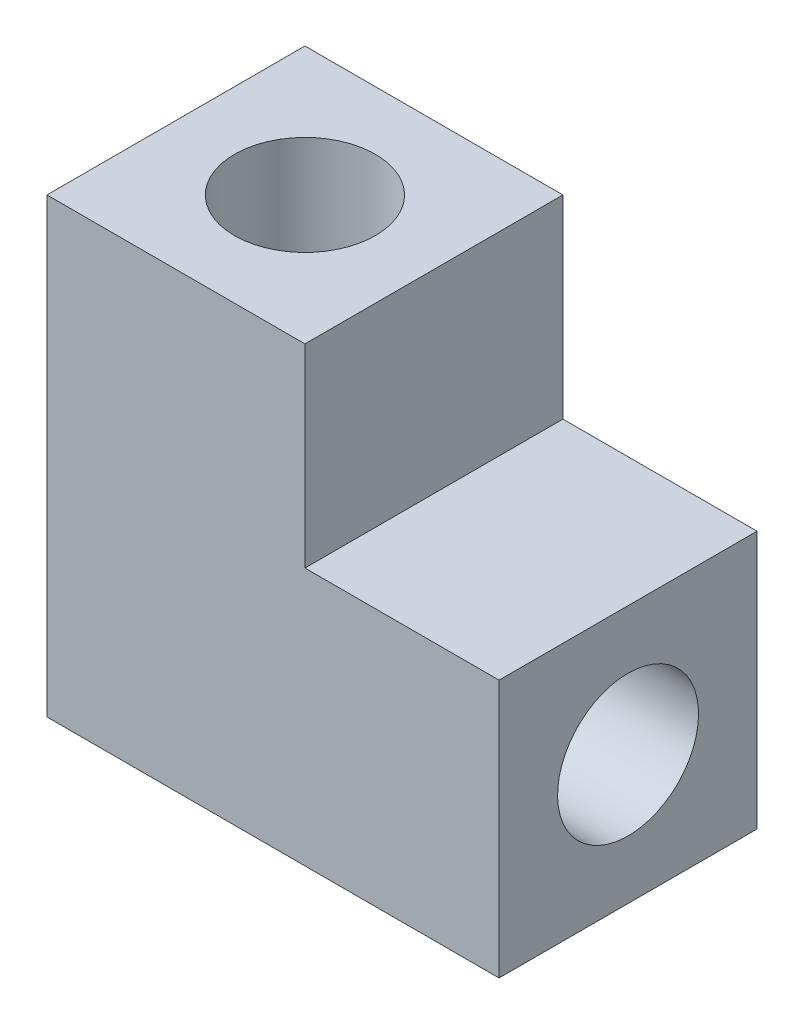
ISO-10303-21;
HEADER;
FILE_DESCRIPTION(('STEP AP214'),'2;1');
FILE_NAME('part.step','',(''),(''),'','','');
FILE_SCHEMA(('AUTOMOTIVE_DESIGN { 1 0 10303 214 1 1 1 1 }'));
ENDSEC;
DATA;
#1=APPLICATION_CONTEXT('core data for automotive mechanical design processes');
#2=APPLICATION_PROTOCOL_DEFINITION('international standard','automotive_design',2000,#1);
#3=PRODUCT_CONTEXT('',#1,'mechanical');
#4=PRODUCT('Part','Part','',(#3));
#5=PRODUCT_RELATED_PRODUCT_CATEGORY('part','',(#4));
#6=PRODUCT_DEFINITION_FORMATION('','',#4);
#7=PRODUCT_DEFINITION_CONTEXT('part definition',#1,'design');
#8=PRODUCT_DEFINITION('design','',#6,#7);
#9=PRODUCT_DEFINITION_SHAPE('','',#8);
#10=(LENGTH_UNIT() NAMED_UNIT(*) SI_UNIT(.MILLI.,.METRE.));
#11=(NAMED_UNIT(*) PLANE_ANGLE_UNIT() SI_UNIT($,.RADIAN.));
#12=(NAMED_UNIT(*) SI_UNIT($,.STERADIAN.) SOLID_ANGLE_UNIT());
#13=UNCERTAINTY_MEASURE_WITH_UNIT(LENGTH_MEASURE(1.E-05),#10,'distance_accuracy_value','');
#14=(GEOMETRIC_REPRESENTATION_CONTEXT(3) GLOBAL_UNCERTAINTY_ASSIGNED_CONTEXT((#13)) GLOBAL_UNIT_ASSIGNED_CONTEXT((#10,
#11,#12)) REPRESENTATION_CONTEXT('',''));
#15=CARTESIAN_POINT('',(0.,0.,0.));
#16=DIRECTION('',(0.,0.,1.));
#17=DIRECTION('',(1.,0.,0.));
#18=AXIS2_PLACEMENT_3D('',#15,#16,#17);
#19=CARTESIAN_POINT('',(0.,0.,9.7));
#20=DIRECTION('',(1.,0.,0.));
#21=DIRECTION('',(0.,1.,0.));
#22=AXIS2_PLACEMENT_3D('',#19,#20,#21);
#23=PLANE('',#22);
#24=DIRECTION('',(0.,-1.,0.));
#25=VECTOR('',#24,1.);
#26=CARTESIAN_POINT('',(0.,0.,0.));
#27=LINE('',#26,#25);
#28=CARTESIAN_POINT('',(0.,17.,0.));
#29=VERTEX_POINT('',#28);
#30=CARTESIAN_POINT('',(0.,0.,0.));
#31=VERTEX_POINT('',#30);
#32=EDGE_CURVE('E107',#29,#31,#27,.T.);
#33=ORIENTED_EDGE('',*,*,#32,.T.);
#34=DIRECTION('',(0.,0.,-1.));
#35=VECTOR('',#34,1.);
#36=CARTESIAN_POINT('',(0.,0.,9.7));
#37=LINE('',#36,#35);
#38=CARTESIAN_POINT('',(0.,0.,9.7));
#39=VERTEX_POINT('',#38);
#40=EDGE_CURVE('E11',#39,#31,#37,.T.);
#41=ORIENTED_EDGE('',*,*,#40,.F.);
#42=DIRECTION('',(0.,-1.,0.));
#43=VECTOR('',#42,1.);
#44=CARTESIAN_POINT('',(0.,0.,9.7));
#45=LINE('',#44,#43);
#46=CARTESIAN_POINT('',(0.,17.,9.7));
#47=VERTEX_POINT('',#46);
#48=EDGE_CURVE('E108',#47,#39,#45,.T.);
#49=ORIENTED_EDGE('',*,*,#48,.F.);
#50=DIRECTION('',(0.,0.,-1.));
#51=VECTOR('',#50,1.);
#52=CARTESIAN_POINT('',(0.,17.,9.7));
#53=LINE('',#52,#51);
#54=EDGE_CURVE('E123',#47,#29,#53,.T.);
#55=ORIENTED_EDGE('',*,*,#54,.T.);
#56=EDGE_LOOP('',(#33,#41,#49,#55));
#57=FACE_BOUND('',#56,.T.);
#58=ADVANCED_FACE('F33',(#57),#23,.F.);
#59=CARTESIAN_POINT('',(0.,0.,9.7));
#60=DIRECTION('',(0.,1.,0.));
#61=DIRECTION('',(0.,0.,1.));
#62=AXIS2_PLACEMENT_3D('',#59,#60,#61);
#63=PLANE('',#62);
#64=DIRECTION('',(1.,0.,0.));
#65=VECTOR('',#64,1.);
#66=CARTESIAN_POINT('',(0.,0.,0.));
#67=LINE('',#66,#65);
#68=CARTESIAN_POINT('',(17.,0.,0.));
#69=VERTEX_POINT('',#68);
#70=EDGE_CURVE('E114',#31,#69,#67,.T.);
#71=ORIENTED_EDGE('',*,*,#70,.T.);
#72=DIRECTION('',(0.,0.,-1.));
#73=VECTOR('',#72,1.);
#74=CARTESIAN_POINT('',(17.,0.,9.7));
#75=LINE('',#74,#73);
#76=CARTESIAN_POINT('',(17.,0.,9.7));
#77=VERTEX_POINT('',#76);
#78=EDGE_CURVE('E40',#77,#69,#75,.T.);
#79=ORIENTED_EDGE('',*,*,#78,.F.);
#80=DIRECTION('',(1.,0.,0.));
#81=VECTOR('',#80,1.);
#82=CARTESIAN_POINT('',(0.,0.,9.7));
#83=LINE('',#82,#81);
#84=EDGE_CURVE('E111',#39,#77,#83,.T.);
#85=ORIENTED_EDGE('',*,*,#84,.F.);
#86=ORIENTED_EDGE('',*,*,#40,.T.);
#87=EDGE_LOOP('',(#71,#79,#85,#86));
#88=FACE_BOUND('',#87,.T.);
#89=ADVANCED_FACE('F135',(#88),#63,.F.);
#90=CARTESIAN_POINT('',(17.,0.,9.7));
#91=DIRECTION('',(-1.,0.,0.));
#92=DIRECTION('',(0.,-1.,0.));
#93=AXIS2_PLACEMENT_3D('',#90,#91,#92);
#94=PLANE('',#93);
#95=CARTESIAN_POINT('',(17.,4.85,4.85));
#96=DIRECTION('',(1.,0.,0.));
#97=DIRECTION('',(0.,1.,0.));
#98=AXIS2_PLACEMENT_3D('',#95,#96,#97);
#99=CIRCLE('',#98,2.65);
#100=CARTESIAN_POINT('',(17.,7.5,4.85));
#101=VERTEX_POINT('',#100);
#102=EDGE_CURVE('E153',#101,#101,#99,.T.);
#103=ORIENTED_EDGE('',*,*,#102,.F.);
#104=EDGE_LOOP('',(#103));
#105=FACE_BOUND('',#104,.T.);
#106=DIRECTION('',(0.,1.,0.));
#107=VECTOR('',#106,1.);
#108=CARTESIAN_POINT('',(17.,0.,0.));
#109=LINE('',#108,#107);
#110=CARTESIAN_POINT('',(17.,9.7,0.));
#111=VERTEX_POINT('',#110);
#112=EDGE_CURVE('E109',#69,#111,#109,.T.);
#113=ORIENTED_EDGE('',*,*,#112,.T.);
#114=DIRECTION('',(0.,0.,1.));
#115=VECTOR('',#114,1.);
#116=CARTESIAN_POINT('',(17.,9.7,-0.000999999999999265));
#117=LINE('',#116,#115);
#118=CARTESIAN_POINT('',(17.,9.7,9.7));
#119=VERTEX_POINT('',#118);
#120=EDGE_CURVE('E47',#111,#119,#117,.T.);
#121=ORIENTED_EDGE('',*,*,#120,.T.);
#122=DIRECTION('',(0.,1.,0.));
#123=VECTOR('',#122,1.);
#124=CARTESIAN_POINT('',(17.,0.,9.7));
#125=LINE('',#124,#123);
#126=EDGE_CURVE('E119',#77,#119,#125,.T.);
#127=ORIENTED_EDGE('',*,*,#126,.F.);
#128=ORIENTED_EDGE('',*,*,#78,.T.);
#129=EDGE_LOOP('',(#113,#121,#127,#128));
#130=FACE_BOUND('',#129,.T.);
#131=ADVANCED_FACE('F129',(#105,#130),#94,.F.);
#132=CARTESIAN_POINT('',(0.,17.,9.7));
#133=DIRECTION('',(0.,-1.,0.));
#134=DIRECTION('',(0.,0.,-1.));
#135=AXIS2_PLACEMENT_3D('',#132,#133,#134);
#136=PLANE('',#135);
#137=CARTESIAN_POINT('',(4.85,17.,4.85));
#138=DIRECTION('',(0.,1.,0.));
#139=DIRECTION('',(0.,0.,1.));
#140=AXIS2_PLACEMENT_3D('',#137,#138,#139);
#141=CIRCLE('',#140,2.65);
#142=CARTESIAN_POINT('',(4.85,17.,7.5));
#143=VERTEX_POINT('',#142);
#144=EDGE_CURVE('E147',#143,#143,#141,.T.);
#145=ORIENTED_EDGE('',*,*,#144,.F.);
#146=EDGE_LOOP('',(#145));
#147=FACE_BOUND('',#146,.T.);
#148=DIRECTION('',(-1.,0.,0.));
#149=VECTOR('',#148,1.);
#150=CARTESIAN_POINT('',(0.,17.,9.7));
#151=LINE('',#150,#149);
#152=CARTESIAN_POINT('',(9.7,17.,9.7));
#153=VERTEX_POINT('',#152);
#154=EDGE_CURVE('E55',#153,#47,#151,.T.);
#155=ORIENTED_EDGE('',*,*,#154,.F.);
#156=DIRECTION('',(0.,0.,1.));
#157=VECTOR('',#156,1.);
#158=CARTESIAN_POINT('',(9.7,17.,-0.000999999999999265));
#159=LINE('',#158,#157);
#160=CARTESIAN_POINT('',(9.7,17.,0.));
#161=VERTEX_POINT('',#160);
#162=EDGE_CURVE('E91',#161,#153,#159,.T.);
#163=ORIENTED_EDGE('',*,*,#162,.F.);
#164=DIRECTION('',(-1.,0.,0.));
#165=VECTOR('',#164,1.);
#166=CARTESIAN_POINT('',(0.,17.,0.));
#167=LINE('',#166,#165);
#168=EDGE_CURVE('E100',#161,#29,#167,.T.);
#169=ORIENTED_EDGE('',*,*,#168,.T.);
#170=ORIENTED_EDGE('',*,*,#54,.F.);
#171=EDGE_LOOP('',(#155,#163,#169,#170));
#172=FACE_BOUND('',#171,.T.);
#173=ADVANCED_FACE('F99',(#147,#172),#136,.F.);
#174=CARTESIAN_POINT('',(0.,17.,9.7));
#175=DIRECTION('',(0.,0.,-1.));
#176=DIRECTION('',(-1.,0.,0.));
#177=AXIS2_PLACEMENT_3D('',#174,#175,#176);
#178=PLANE('',#177);
#179=DIRECTION('',(1.,0.,0.));
#180=VECTOR('',#179,1.);
#181=CARTESIAN_POINT('',(9.7,9.7,9.7));
#182=LINE('',#181,#180);
#183=CARTESIAN_POINT('',(9.7,9.7,9.7));
#184=VERTEX_POINT('',#183);
#185=EDGE_CURVE('E141',#184,#119,#182,.T.);
#186=ORIENTED_EDGE('',*,*,#185,.F.);
#187=DIRECTION('',(0.,-1.,0.));
#188=VECTOR('',#187,1.);
#189=CARTESIAN_POINT('',(9.7,17.,9.7));
#190=LINE('',#189,#188);
#191=EDGE_CURVE('E95',#153,#184,#190,.T.);
#192=ORIENTED_EDGE('',*,*,#191,.F.);
#193=ORIENTED_EDGE('',*,*,#154,.T.);
#194=ORIENTED_EDGE('',*,*,#48,.T.);
#195=ORIENTED_EDGE('',*,*,#84,.T.);
#196=ORIENTED_EDGE('',*,*,#126,.T.);
#197=EDGE_LOOP('',(#186,#192,#193,#194,#195,#196));
#198=FACE_BOUND('',#197,.T.);
#199=ADVANCED_FACE('F140',(#198),#178,.F.);
#200=CARTESIAN_POINT('',(0.,17.,0.));
#201=DIRECTION('',(0.,0.,-1.));
#202=DIRECTION('',(-1.,0.,0.));
#203=AXIS2_PLACEMENT_3D('',#200,#201,#202);
#204=PLANE('',#203);
#205=DIRECTION('',(0.,-1.,0.));
#206=VECTOR('',#205,1.);
#207=CARTESIAN_POINT('',(9.7,17.,0.));
#208=LINE('',#207,#206);
#209=CARTESIAN_POINT('',(9.7,9.7,0.));
#210=VERTEX_POINT('',#209);
#211=EDGE_CURVE('E87',#161,#210,#208,.T.);
#212=ORIENTED_EDGE('',*,*,#211,.T.);
#213=DIRECTION('',(1.,0.,0.));
#214=VECTOR('',#213,1.);
#215=CARTESIAN_POINT('',(9.7,9.7,0.));
#216=LINE('',#215,#214);
#217=EDGE_CURVE('E102',#210,#111,#216,.T.);
#218=ORIENTED_EDGE('',*,*,#217,.T.);
#219=ORIENTED_EDGE('',*,*,#112,.F.);
#220=ORIENTED_EDGE('',*,*,#70,.F.);
#221=ORIENTED_EDGE('',*,*,#32,.F.);
#222=ORIENTED_EDGE('',*,*,#168,.F.);
#223=EDGE_LOOP('',(#212,#218,#219,#220,#221,#222));
#224=FACE_BOUND('',#223,.T.);
#225=ADVANCED_FACE('F105',(#224),#204,.T.);
#226=CARTESIAN_POINT('',(9.7,17.,-0.000999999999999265));
#227=DIRECTION('',(-1.,0.,0.));
#228=DIRECTION('',(0.,-1.,0.));
#229=AXIS2_PLACEMENT_3D('',#226,#227,#228);
#230=PLANE('',#229);
#231=ORIENTED_EDGE('',*,*,#162,.T.);
#232=ORIENTED_EDGE('',*,*,#191,.T.);
#233=DIRECTION('',(0.,0.,1.));
#234=VECTOR('',#233,1.);
#235=CARTESIAN_POINT('',(9.7,9.7,-0.000999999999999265));
#236=LINE('',#235,#234);
#237=EDGE_CURVE('E92',#210,#184,#236,.T.);
#238=ORIENTED_EDGE('',*,*,#237,.F.);
#239=ORIENTED_EDGE('',*,*,#211,.F.);
#240=EDGE_LOOP('',(#231,#232,#238,#239));
#241=FACE_BOUND('',#240,.T.);
#242=ADVANCED_FACE('F89',(#241),#230,.F.);
#243=CARTESIAN_POINT('',(9.7,9.7,-0.000999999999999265));
#244=DIRECTION('',(0.,-1.,0.));
#245=DIRECTION('',(0.,0.,-1.));
#246=AXIS2_PLACEMENT_3D('',#243,#244,#245);
#247=PLANE('',#246);
#248=ORIENTED_EDGE('',*,*,#237,.T.);
#249=ORIENTED_EDGE('',*,*,#185,.T.);
#250=ORIENTED_EDGE('',*,*,#120,.F.);
#251=ORIENTED_EDGE('',*,*,#217,.F.);
#252=EDGE_LOOP('',(#248,#249,#250,#251));
#253=FACE_BOUND('',#252,.T.);
#254=ADVANCED_FACE('F201',(#253),#247,.F.);
#255=CARTESIAN_POINT('',(4.85,8.21,4.85));
#256=DIRECTION('',(0.,1.,0.));
#257=DIRECTION('',(0.,0.,1.));
#258=AXIS2_PLACEMENT_3D('',#255,#256,#257);
#259=CYLINDRICAL_SURFACE('',#258,2.65);
#260=CARTESIAN_POINT('',(4.85,8.21,4.85));
#261=DIRECTION('',(0.,1.,0.));
#262=DIRECTION('',(0.,0.,1.));
#263=AXIS2_PLACEMENT_3D('',#260,#261,#262);
#264=CIRCLE('',#263,2.65);
#265=CARTESIAN_POINT('',(4.85,8.21,7.5));
#266=VERTEX_POINT('',#265);
#267=EDGE_CURVE('E96',#266,#266,#264,.T.);
#268=CARTESIAN_POINT('',(4.85,8.21,7.5));
#269=CARTESIAN_POINT('',(4.85,8.3015625,7.5));
#270=CARTESIAN_POINT('',(4.85,8.393125,7.5));
#271=CARTESIAN_POINT('',(4.85,8.57625,7.5));
#272=CARTESIAN_POINT('',(4.85,8.6678125,7.5));
#273=CARTESIAN_POINT('',(4.85,8.8509375,7.5));
#274=CARTESIAN_POINT('',(4.85,8.9425,7.5));
#275=CARTESIAN_POINT('',(4.85,9.125625,7.5));
#276=CARTESIAN_POINT('',(4.85,9.2171875,7.5));
#277=CARTESIAN_POINT('',(4.85,9.4003125,7.5));
#278=CARTESIAN_POINT('',(4.85,9.491875,7.5));
#279=CARTESIAN_POINT('',(4.85,9.675,7.5));
#280=CARTESIAN_POINT('',(4.85,9.7665625,7.5));
#281=CARTESIAN_POINT('',(4.85,9.9496875,7.5));
#282=CARTESIAN_POINT('',(4.85,10.04125,7.5));
#283=CARTESIAN_POINT('',(4.85,10.224375,7.5));
#284=CARTESIAN_POINT('',(4.85,10.3159375,7.5));
#285=CARTESIAN_POINT('',(4.85,10.4990625,7.5));
#286=CARTESIAN_POINT('',(4.85,10.590625,7.5));
#287=CARTESIAN_POINT('',(4.85,10.77375,7.5));
#288=CARTESIAN_POINT('',(4.85,10.8653125,7.5));
#289=CARTESIAN_POINT('',(4.85,11.0484375,7.5));
#290=CARTESIAN_POINT('',(4.85,11.14,7.5));
#291=CARTESIAN_POINT('',(4.85,11.323125,7.5));
#292=CARTESIAN_POINT('',(4.85,11.4146875,7.5));
#293=CARTESIAN_POINT('',(4.85,11.5978125,7.5));
#294=CARTESIAN_POINT('',(4.85,11.689375,7.5));
#295=CARTESIAN_POINT('',(4.85,11.8725,7.5));
#296=CARTESIAN_POINT('',(4.85,11.9640625,7.5));
#297=CARTESIAN_POINT('',(4.85,12.1471875,7.5));
#298=CARTESIAN_POINT('',(4.85,12.23875,7.5));
#299=CARTESIAN_POINT('',(4.85,12.421875,7.5));
#300=CARTESIAN_POINT('',(4.85,12.5134375,7.5));
#301=CARTESIAN_POINT('',(4.85,12.6965625,7.5));
#302=CARTESIAN_POINT('',(4.85,12.788125,7.5));
#303=CARTESIAN_POINT('',(4.85,12.97125,7.5));
#304=CARTESIAN_POINT('',(4.85,13.0628125,7.5));
#305=CARTESIAN_POINT('',(4.85,13.2459375,7.5));
#306=CARTESIAN_POINT('',(4.85,13.3375,7.5));
#307=CARTESIAN_POINT('',(4.85,13.520625,7.5));
#308=CARTESIAN_POINT('',(4.85,13.6121875,7.5));
#309=CARTESIAN_POINT('',(4.85,13.7953125,7.5));
#310=CARTESIAN_POINT('',(4.85,13.886875,7.5));
#311=CARTESIAN_POINT('',(4.85,14.07,7.5));
#312=CARTESIAN_POINT('',(4.85,14.1615625,7.5));
#313=CARTESIAN_POINT('',(4.85,14.3446875,7.5));
#314=CARTESIAN_POINT('',(4.85,14.43625,7.5));
#315=CARTESIAN_POINT('',(4.85,14.619375,7.5));
#316=CARTESIAN_POINT('',(4.85,14.7109375,7.5));
#317=CARTESIAN_POINT('',(4.85,14.8940625,7.5));
#318=CARTESIAN_POINT('',(4.85,14.985625,7.5));
#319=CARTESIAN_POINT('',(4.85,15.16875,7.5));
#320=CARTESIAN_POINT('',(4.85,15.2603125,7.5));
#321=CARTESIAN_POINT('',(4.85,15.4434375,7.5));
#322=CARTESIAN_POINT('',(4.85,15.535,7.5));
#323=CARTESIAN_POINT('',(4.85,15.718125,7.5));
#324=CARTESIAN_POINT('',(4.85,15.8096875,7.5));
#325=CARTESIAN_POINT('',(4.85,15.9928125,7.5));
#326=CARTESIAN_POINT('',(4.85,16.084375,7.5));
#327=CARTESIAN_POINT('',(4.85,16.2675,7.5));
#328=CARTESIAN_POINT('',(4.85,16.3590625,7.5));
#329=CARTESIAN_POINT('',(4.85,16.5421875,7.5));
#330=CARTESIAN_POINT('',(4.85,16.63375,7.5));
#331=CARTESIAN_POINT('',(4.85,16.816875,7.5));
#332=CARTESIAN_POINT('',(4.85,16.9084375,7.5));
#333=CARTESIAN_POINT('',(4.85,17.,7.5));
#334=B_SPLINE_CURVE_WITH_KNOTS('',3,(#268,#269,#270,#271,#272,#273,#274,#275,#276,#277,#278,
#279,#280,#281,#282,#283,#284,#285,#286,#287,#288,#289,#290,#291,#292,#293,#294,#295,#296,#297,
#298,#299,#300,#301,#302,#303,#304,#305,#306,#307,#308,#309,#310,#311,#312,#313,#314,#315,#316,
#317,#318,#319,#320,#321,#322,#323,#324,#325,#326,#327,#328,#329,#330,#331,#332,#333),
.UNSPECIFIED.,.F.,.F.,(4,2,2,2,2,2,2,2,2,2,2,2,2,2,2,2,2,2,2,2,2,2,2,2,2,2,2,2,2,2,2,2,4),(0.,
0.274687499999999,0.549375,0.824062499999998,1.09875,1.3734375,1.648125,1.9228125,2.1975,
2.4721875,2.746875,3.0215625,3.29625,3.5709375,3.845625,4.1203125,4.395,4.6696875,4.944375,
5.2190625,5.49375,5.7684375,6.043125,6.3178125,6.5925,6.8671875,7.141875,7.4165625,7.69125,
7.9659375,8.240625,8.5153125,8.79),.UNSPECIFIED.);
#335=EDGE_CURVE('BSEAM210',#266,#143,#334,.T.);
#336=ORIENTED_EDGE('',*,*,#267,.F.);
#337=ORIENTED_EDGE('',*,*,#144,.T.);
#338=ORIENTED_EDGE('',*,*,#335,.T.);
#339=ORIENTED_EDGE('',*,*,#335,.F.);
#340=EDGE_LOOP('',(#336,#338,#337,#339));
#341=FACE_BOUND('',#340,.T.);
#342=ADVANCED_FACE('F210',(#341),#259,.F.);
#343=CARTESIAN_POINT('',(4.85,8.21,4.85));
#344=DIRECTION('',(0.,1.,0.));
#345=DIRECTION('',(0.,0.,1.));
#346=AXIS2_PLACEMENT_3D('',#343,#344,#345);
#347=PLANE('',#346);
#348=ORIENTED_EDGE('',*,*,#267,.T.);
#349=EDGE_LOOP('',(#348));
#350=FACE_BOUND('',#349,.T.);
#351=ADVANCED_FACE('F224',(#350),#347,.T.);
#352=CARTESIAN_POINT('',(8.21,4.85,4.85));
#353=DIRECTION('',(1.,0.,0.));
#354=DIRECTION('',(0.,1.,0.));
#355=AXIS2_PLACEMENT_3D('',#352,#353,#354);
#356=CYLINDRICAL_SURFACE('',#355,2.65);
#357=CARTESIAN_POINT('',(8.21,4.85,4.85));
#358=DIRECTION('',(1.,0.,0.));
#359=DIRECTION('',(0.,1.,0.));
#360=AXIS2_PLACEMENT_3D('',#357,#358,#359);
#361=CIRCLE('',#360,2.65);
#362=CARTESIAN_POINT('',(8.21,7.5,4.85));
#363=VERTEX_POINT('',#362);
#364=EDGE_CURVE('E150',#363,#363,#361,.T.);
#365=CARTESIAN_POINT('',(8.21,7.5,4.85));
#366=CARTESIAN_POINT('',(8.3015625,7.5,4.85));
#367=CARTESIAN_POINT('',(8.393125,7.5,4.85));
#368=CARTESIAN_POINT('',(8.57625,7.5,4.85));
#369=CARTESIAN_POINT('',(8.6678125,7.5,4.85));
#370=CARTESIAN_POINT('',(8.8509375,7.5,4.85));
#371=CARTESIAN_POINT('',(8.9425,7.5,4.85));
#372=CARTESIAN_POINT('',(9.125625,7.5,4.85));
#373=CARTESIAN_POINT('',(9.2171875,7.5,4.85));
#374=CARTESIAN_POINT('',(9.4003125,7.5,4.85));
#375=CARTESIAN_POINT('',(9.491875,7.5,4.85));
#376=CARTESIAN_POINT('',(9.675,7.5,4.85));
#377=CARTESIAN_POINT('',(9.7665625,7.5,4.85));
#378=CARTESIAN_POINT('',(9.9496875,7.5,4.85));
#379=CARTESIAN_POINT('',(10.04125,7.5,4.85));
#380=CARTESIAN_POINT('',(10.224375,7.5,4.85));
#381=CARTESIAN_POINT('',(10.3159375,7.5,4.85));
#382=CARTESIAN_POINT('',(10.4990625,7.5,4.85));
#383=CARTESIAN_POINT('',(10.590625,7.5,4.85));
#384=CARTESIAN_POINT('',(10.77375,7.5,4.85));
#385=CARTESIAN_POINT('',(10.8653125,7.5,4.85));
#386=CARTESIAN_POINT('',(11.0484375,7.5,4.85));
#387=CARTESIAN_POINT('',(11.14,7.5,4.85));
#388=CARTESIAN_POINT('',(11.323125,7.5,4.85));
#389=CARTESIAN_POINT('',(11.4146875,7.5,4.85));
#390=CARTESIAN_POINT('',(11.5978125,7.5,4.85));
#391=CARTESIAN_POINT('',(11.689375,7.5,4.85));
#392=CARTESIAN_POINT('',(11.8725,7.5,4.85));
#393=CARTESIAN_POINT('',(11.9640625,7.5,4.85));
#394=CARTESIAN_POINT('',(12.1471875,7.5,4.85));
#395=CARTESIAN_POINT('',(12.23875,7.5,4.85));
#396=CARTESIAN_POINT('',(12.421875,7.5,4.85));
#397=CARTESIAN_POINT('',(12.5134375,7.5,4.85));
#398=CARTESIAN_POINT('',(12.6965625,7.5,4.85));
#399=CARTESIAN_POINT('',(12.788125,7.5,4.85));
#400=CARTESIAN_POINT('',(12.97125,7.5,4.85));
#401=CARTESIAN_POINT('',(13.0628125,7.5,4.85));
#402=CARTESIAN_POINT('',(13.2459375,7.5,4.85));
#403=CARTESIAN_POINT('',(13.3375,7.5,4.85));
#404=CARTESIAN_POINT('',(13.520625,7.5,4.85));
#405=CARTESIAN_POINT('',(13.6121875,7.5,4.85));
#406=CARTESIAN_POINT('',(13.7953125,7.5,4.85));
#407=CARTESIAN_POINT('',(13.886875,7.5,4.85));
#408=CARTESIAN_POINT('',(14.07,7.5,4.85));
#409=CARTESIAN_POINT('',(14.1615625,7.5,4.85));
#410=CARTESIAN_POINT('',(14.3446875,7.5,4.85));
#411=CARTESIAN_POINT('',(14.43625,7.5,4.85));
#412=CARTESIAN_POINT('',(14.619375,7.5,4.85));
#413=CARTESIAN_POINT('',(14.7109375,7.5,4.85));
#414=CARTESIAN_POINT('',(14.8940625,7.5,4.85));
#415=CARTESIAN_POINT('',(14.985625,7.5,4.85));
#416=CARTESIAN_POINT('',(15.16875,7.5,4.85));
#417=CARTESIAN_POINT('',(15.2603125,7.5,4.85));
#418=CARTESIAN_POINT('',(15.4434375,7.5,4.85));
#419=CARTESIAN_POINT('',(15.535,7.5,4.85));
#420=CARTESIAN_POINT('',(15.718125,7.5,4.85));
#421=CARTESIAN_POINT('',(15.8096875,7.5,4.85));
#422=CARTESIAN_POINT('',(15.9928125,7.5,4.85));
#423=CARTESIAN_POINT('',(16.084375,7.5,4.85));
#424=CARTESIAN_POINT('',(16.2675,7.5,4.85));
#425=CARTESIAN_POINT('',(16.3590625,7.5,4.85));
#426=CARTESIAN_POINT('',(16.5421875,7.5,4.85));
#427=CARTESIAN_POINT('',(16.63375,7.5,4.85));
#428=CARTESIAN_POINT('',(16.816875,7.5,4.85));
#429=CARTESIAN_POINT('',(16.9084375,7.5,4.85));
#430=CARTESIAN_POINT('',(17.,7.5,4.85));
#431=B_SPLINE_CURVE_WITH_KNOTS('',3,(#365,#366,#367,#368,#369,#370,#371,#372,#373,#374,#375,
#376,#377,#378,#379,#380,#381,#382,#383,#384,#385,#386,#387,#388,#389,#390,#391,#392,#393,#394,
#395,#396,#397,#398,#399,#400,#401,#402,#403,#404,#405,#406,#407,#408,#409,#410,#411,#412,#413,
#414,#415,#416,#417,#418,#419,#420,#421,#422,#423,#424,#425,#426,#427,#428,#429,#430),
.UNSPECIFIED.,.F.,.F.,(4,2,2,2,2,2,2,2,2,2,2,2,2,2,2,2,2,2,2,2,2,2,2,2,2,2,2,2,2,2,2,2,4),(0.,
0.274687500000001,0.549375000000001,0.824062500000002,1.09875,1.3734375,1.648125,1.9228125,
2.1975,2.4721875,2.746875,3.0215625,3.29625,3.5709375,3.845625,4.1203125,4.395,4.6696875,
4.944375,5.2190625,5.49375,5.7684375,6.043125,6.3178125,6.5925,6.8671875,7.141875,7.4165625,
7.69125,7.9659375,8.240625,8.5153125,8.79),.UNSPECIFIED.);
#432=EDGE_CURVE('BSEAM157',#363,#101,#431,.T.);
#433=ORIENTED_EDGE('',*,*,#364,.F.);
#434=ORIENTED_EDGE('',*,*,#102,.T.);
#435=ORIENTED_EDGE('',*,*,#432,.T.);
#436=ORIENTED_EDGE('',*,*,#432,.F.);
#437=EDGE_LOOP('',(#433,#435,#434,#436));
#438=FACE_BOUND('',#437,.T.);
#439=ADVANCED_FACE('F157',(#438),#356,.F.);
#440=CARTESIAN_POINT('',(8.21,4.85,4.85));
#441=DIRECTION('',(1.,0.,0.));
#442=DIRECTION('',(0.,1.,0.));
#443=AXIS2_PLACEMENT_3D('',#440,#441,#442);
#444=PLANE('',#443);
#445=ORIENTED_EDGE('',*,*,#364,.T.);
#446=EDGE_LOOP('',(#445));
#447=FACE_BOUND('',#446,.T.);
#448=ADVANCED_FACE('F246',(#447),#444,.T.);
#449=CLOSED_SHELL('',(#58,#89,#131,#173,#199,#225,#242,#254,#342,#351,#439,#448));
#450=MANIFOLD_SOLID_BREP('B2',#449);
#451=ADVANCED_BREP_SHAPE_REPRESENTATION('',(#18,#450),#14);
#452=SHAPE_DEFINITION_REPRESENTATION(#9,#451);
ENDSEC;
END-ISO-10303-21;
